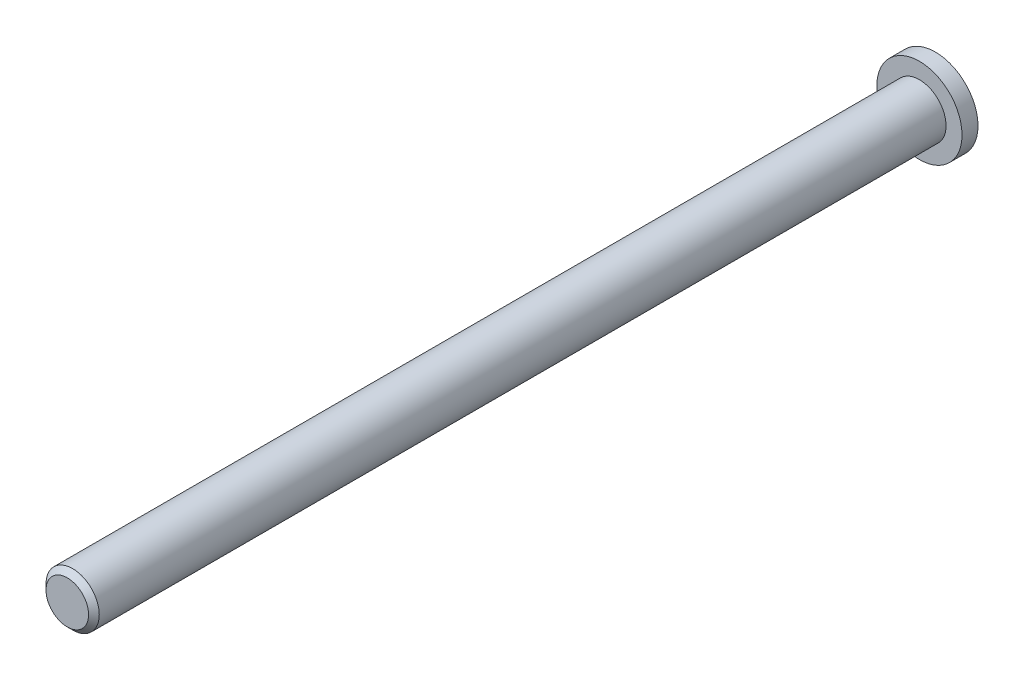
from build123d import *

# Parameters (mm, degrees)
SKETCH1_R           = 4
BOSS_EXTRUDE1_DEPTH = 1.5
SKETCH2_R           = 2.5
BOSS_EXTRUDE2_DEPTH = 80
CHAMFER1_SIZE       = 0.5


with BuildPart() as part:
    # Sketch1 → Boss-Extrude1 (new body)
    with BuildSketch(Plane.XY):
        Circle(SKETCH1_R)
    extrude(amount=BOSS_EXTRUDE1_DEPTH)

    # Sketch2 → Boss-Extrude2 (add)
    with BuildSketch(Plane.XY.offset(1.5)):
        Circle(SKETCH2_R)
    extrude(amount=BOSS_EXTRUDE2_DEPTH)

    # Chamfer1
    chamfer1_edges = [part.edges().sort_by_distance(p)[0] for p in [
        (-2.5, 0, 81.5),
    ]]
    chamfer(chamfer1_edges, length=CHAMFER1_SIZE)


solid = part.part
